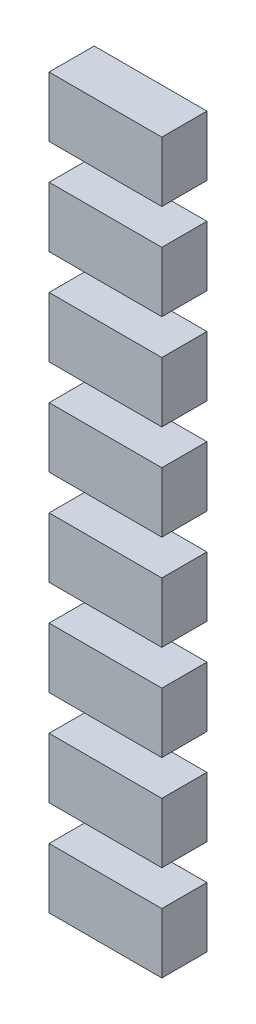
from build123d import *

# Parameters (mm, degrees)
EIGHT_FRONT_RESISTOR_CLEARANCE_ENVELOPES_START = -1.2
SKETCH_1_W                                     = 3
SKETCH_1_H                                     = 1.6
EIGHT_FRONT_RESISTOR_CLEARANCE_ENVELOPES_DEPTH = 1.2
EIGHT_FRONT_RESISTOR_CLEARANCE_ENVEL_START     = -1.2
EIGHT_FRONT_RESISTOR_CLEARANCE_ENVEL_2_DEPTH   = 1.2
EIGHT_FRONT_RESISTOR_CLEARANCE_ENVEL_3_DEPTH   = 1.2
EIGHT_FRONT_RESISTOR_CLEARANCE_ENVEL_4_DEPTH   = 1.2
EIGHT_FRONT_RESISTOR_CLEARANCE_ENVEL_5_DEPTH   = 1.2
EIGHT_FRONT_RESISTOR_CLEARANCE_ENVEL_6_DEPTH   = 1.2
EIGHT_FRONT_RESISTOR_CLEARANCE_ENVEL_7_DEPTH   = 1.2
EIGHT_FRONT_RESISTOR_CLEARANCE_ENVEL_8_DEPTH   = 1.2


with BuildPart() as part:
    # Sketch 1 → Eight_front_resistor_clearance_envelopes (new body)
    with BuildSketch(Plane.XY.offset(EIGHT_FRONT_RESISTOR_CLEARANCE_ENVELOPES_START)):
        with Locations((29.5, -32.444)):
            Rectangle(SKETCH_1_W, SKETCH_1_H)
    extrude(amount=EIGHT_FRONT_RESISTOR_CLEARANCE_ENVELOPES_DEPTH)


with BuildPart() as body_2:
    # Sketch 1 → Eight_front_resistor_clearance_envel 2 (new body)
    with BuildSketch(Plane.XY.offset(EIGHT_FRONT_RESISTOR_CLEARANCE_ENVEL_START)):
        with Locations((29.5, -29.904)):
            Rectangle(SKETCH_1_W, SKETCH_1_H)
    extrude(amount=EIGHT_FRONT_RESISTOR_CLEARANCE_ENVEL_2_DEPTH)


with BuildPart() as body_3:
    # Sketch 1 → Eight_front_resistor_clearance_envel 3 (new body)
    with BuildSketch(Plane.XY.offset(EIGHT_FRONT_RESISTOR_CLEARANCE_ENVEL_START)):
        with Locations((29.5, -27.364)):
            Rectangle(SKETCH_1_W, SKETCH_1_H)
    extrude(amount=EIGHT_FRONT_RESISTOR_CLEARANCE_ENVEL_3_DEPTH)


with BuildPart() as body_4:
    # Sketch 1 → Eight_front_resistor_clearance_envel 4 (new body)
    with BuildSketch(Plane.XY.offset(EIGHT_FRONT_RESISTOR_CLEARANCE_ENVEL_START)):
        with Locations((29.5, -24.824)):
            Rectangle(SKETCH_1_W, SKETCH_1_H)
    extrude(amount=EIGHT_FRONT_RESISTOR_CLEARANCE_ENVEL_4_DEPTH)


with BuildPart() as body_5:
    # Sketch 1 → Eight_front_resistor_clearance_envel 5 (new body)
    with BuildSketch(Plane.XY.offset(EIGHT_FRONT_RESISTOR_CLEARANCE_ENVEL_START)):
        with Locations((29.5, -19.744)):
            Rectangle(SKETCH_1_W, SKETCH_1_H)
    extrude(amount=EIGHT_FRONT_RESISTOR_CLEARANCE_ENVEL_5_DEPTH)


with BuildPart() as body_6:
    # Sketch 1 → Eight_front_resistor_clearance_envel 6 (new body)
    with BuildSketch(Plane.XY.offset(EIGHT_FRONT_RESISTOR_CLEARANCE_ENVEL_START)):
        with Locations((29.5, -17.204)):
            Rectangle(SKETCH_1_W, SKETCH_1_H)
    extrude(amount=EIGHT_FRONT_RESISTOR_CLEARANCE_ENVEL_6_DEPTH)


with BuildPart() as body_7:
    # Sketch 1 → Eight_front_resistor_clearance_envel 7 (new body)
    with BuildSketch(Plane.XY.offset(EIGHT_FRONT_RESISTOR_CLEARANCE_ENVEL_START)):
        with Locations((29.5, -22.284)):
            Rectangle(SKETCH_1_W, SKETCH_1_H)
    extrude(amount=EIGHT_FRONT_RESISTOR_CLEARANCE_ENVEL_7_DEPTH)


with BuildPart() as body_8:
    # Sketch 1 → Eight_front_resistor_clearance_envel 8 (new body)
    with BuildSketch(Plane.XY.offset(EIGHT_FRONT_RESISTOR_CLEARANCE_ENVEL_START)):
        with Locations((29.5, -14.664)):
            Rectangle(SKETCH_1_W, SKETCH_1_H)
    extrude(amount=EIGHT_FRONT_RESISTOR_CLEARANCE_ENVEL_8_DEPTH)


solid = Compound([part.part, body_2.part, body_3.part, body_4.part, body_5.part, body_6.part, body_7.part, body_8.part])
